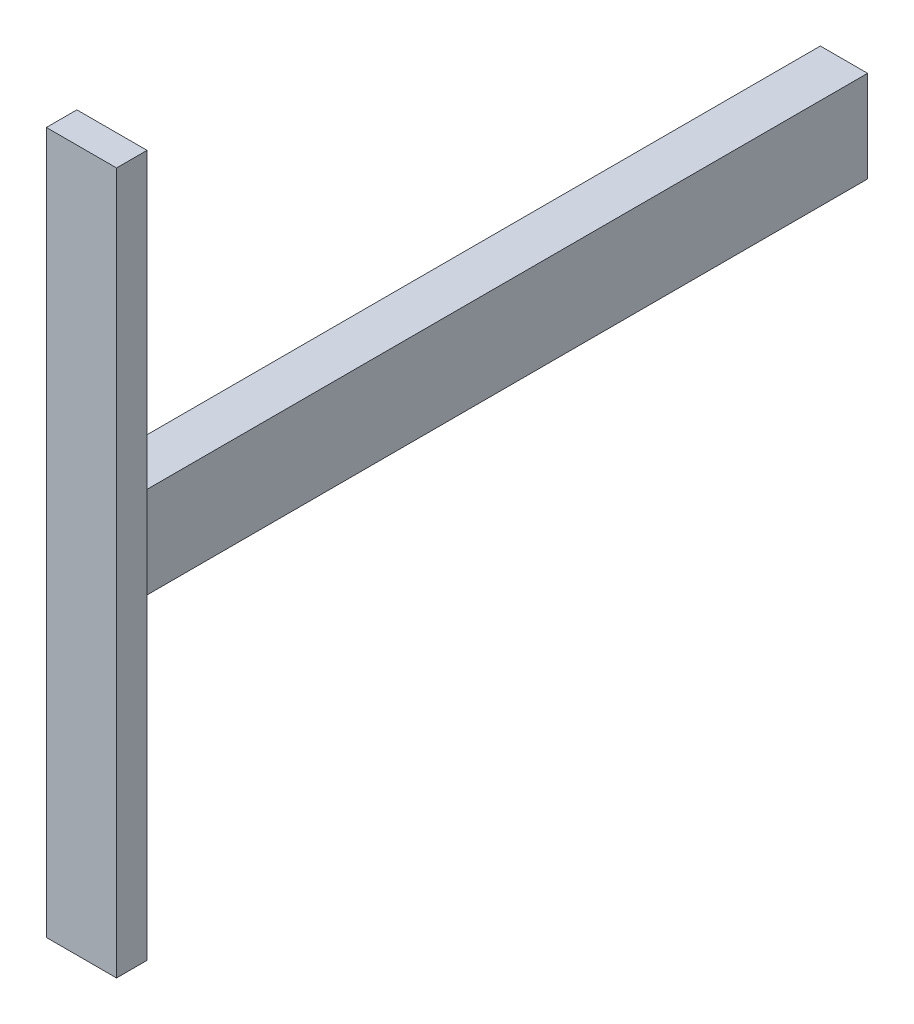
ISO-10303-21;
HEADER;
FILE_DESCRIPTION(('STEP AP214'),'2;1');
FILE_NAME('part.step','',(''),(''),'','','');
FILE_SCHEMA(('AUTOMOTIVE_DESIGN { 1 0 10303 214 1 1 1 1 }'));
ENDSEC;
DATA;
#1=APPLICATION_CONTEXT('core data for automotive mechanical design processes');
#2=APPLICATION_PROTOCOL_DEFINITION('international standard','automotive_design',2000,#1);
#3=PRODUCT_CONTEXT('',#1,'mechanical');
#4=PRODUCT('Part','Part','',(#3));
#5=PRODUCT_RELATED_PRODUCT_CATEGORY('part','',(#4));
#6=PRODUCT_DEFINITION_FORMATION('','',#4);
#7=PRODUCT_DEFINITION_CONTEXT('part definition',#1,'design');
#8=PRODUCT_DEFINITION('design','',#6,#7);
#9=PRODUCT_DEFINITION_SHAPE('','',#8);
#10=(LENGTH_UNIT() NAMED_UNIT(*) SI_UNIT(.MILLI.,.METRE.));
#11=(NAMED_UNIT(*) PLANE_ANGLE_UNIT() SI_UNIT($,.RADIAN.));
#12=(NAMED_UNIT(*) SI_UNIT($,.STERADIAN.) SOLID_ANGLE_UNIT());
#13=UNCERTAINTY_MEASURE_WITH_UNIT(LENGTH_MEASURE(1.E-05),#10,'distance_accuracy_value','');
#14=(GEOMETRIC_REPRESENTATION_CONTEXT(3) GLOBAL_UNCERTAINTY_ASSIGNED_CONTEXT((#13)) GLOBAL_UNIT_ASSIGNED_CONTEXT((#10,
#11,#12)) REPRESENTATION_CONTEXT('',''));
#15=CARTESIAN_POINT('',(0.,0.,0.));
#16=DIRECTION('',(0.,0.,1.));
#17=DIRECTION('',(1.,0.,0.));
#18=AXIS2_PLACEMENT_3D('',#15,#16,#17);
#19=CARTESIAN_POINT('',(-29.21,584.2,-12.7));
#20=DIRECTION('',(0.,0.,1.));
#21=DIRECTION('',(1.,0.,0.));
#22=AXIS2_PLACEMENT_3D('',#19,#20,#21);
#23=PLANE('',#22);
#24=DIRECTION('',(-1.,0.,0.));
#25=VECTOR('',#24,1.);
#26=CARTESIAN_POINT('',(-29.21,0.,-12.7));
#27=LINE('',#26,#25);
#28=CARTESIAN_POINT('',(29.21,0.,-12.7));
#29=VERTEX_POINT('',#28);
#30=CARTESIAN_POINT('',(-29.21,0.,-12.7));
#31=VERTEX_POINT('',#30);
#32=EDGE_CURVE('E240',#29,#31,#27,.T.);
#33=ORIENTED_EDGE('',*,*,#32,.T.);
#34=DIRECTION('',(0.,-1.,0.));
#35=VECTOR('',#34,1.);
#36=CARTESIAN_POINT('',(-29.21,584.2,-12.7));
#37=LINE('',#36,#35);
#38=CARTESIAN_POINT('',(-29.21,584.2,-12.7));
#39=VERTEX_POINT('',#38);
#40=EDGE_CURVE('E48',#39,#31,#37,.T.);
#41=ORIENTED_EDGE('',*,*,#40,.F.);
#42=DIRECTION('',(-1.,0.,0.));
#43=VECTOR('',#42,1.);
#44=CARTESIAN_POINT('',(-29.21,584.2,-12.7));
#45=LINE('',#44,#43);
#46=CARTESIAN_POINT('',(29.21,584.2,-12.7));
#47=VERTEX_POINT('',#46);
#48=EDGE_CURVE('E226',#47,#39,#45,.T.);
#49=ORIENTED_EDGE('',*,*,#48,.F.);
#50=DIRECTION('',(0.,-1.,0.));
#51=VECTOR('',#50,1.);
#52=CARTESIAN_POINT('',(29.21,584.2,-12.7));
#53=LINE('',#52,#51);
#54=EDGE_CURVE('E11',#47,#29,#53,.T.);
#55=ORIENTED_EDGE('',*,*,#54,.T.);
#56=EDGE_LOOP('',(#33,#41,#49,#55));
#57=FACE_BOUND('',#56,.T.);
#58=DIRECTION('',(0.,-1.,0.));
#59=VECTOR('',#58,1.);
#60=CARTESIAN_POINT('',(19.685,254.,-12.7));
#61=LINE('',#60,#59);
#62=CARTESIAN_POINT('',(19.685,330.2,-12.7));
#63=VERTEX_POINT('',#62);
#64=CARTESIAN_POINT('',(19.685,254.,-12.7));
#65=VERTEX_POINT('',#64);
#66=EDGE_CURVE('E148',#63,#65,#61,.T.);
#67=ORIENTED_EDGE('',*,*,#66,.F.);
#68=DIRECTION('',(1.,0.,0.));
#69=VECTOR('',#68,1.);
#70=CARTESIAN_POINT('',(19.685,330.2,-12.7));
#71=LINE('',#70,#69);
#72=CARTESIAN_POINT('',(-19.685,330.2,-12.7));
#73=VERTEX_POINT('',#72);
#74=EDGE_CURVE('E187',#73,#63,#71,.T.);
#75=ORIENTED_EDGE('',*,*,#74,.F.);
#76=DIRECTION('',(0.,1.,0.));
#77=VECTOR('',#76,1.);
#78=CARTESIAN_POINT('',(-19.685,254.,-12.7));
#79=LINE('',#78,#77);
#80=CARTESIAN_POINT('',(-19.685,254.,-12.7));
#81=VERTEX_POINT('',#80);
#82=EDGE_CURVE('E60',#81,#73,#79,.T.);
#83=ORIENTED_EDGE('',*,*,#82,.F.);
#84=DIRECTION('',(-1.,0.,0.));
#85=VECTOR('',#84,1.);
#86=CARTESIAN_POINT('',(19.685,254.,-12.7));
#87=LINE('',#86,#85);
#88=EDGE_CURVE('E55',#65,#81,#87,.T.);
#89=ORIENTED_EDGE('',*,*,#88,.F.);
#90=EDGE_LOOP('',(#67,#75,#83,#89));
#91=FACE_BOUND('',#90,.T.);
#92=ADVANCED_FACE('F39',(#57,#91),#23,.F.);
#93=CARTESIAN_POINT('',(29.21,584.2,-12.7));
#94=DIRECTION('',(-1.,0.,0.));
#95=DIRECTION('',(0.,0.,1.));
#96=AXIS2_PLACEMENT_3D('',#93,#94,#95);
#97=PLANE('',#96);
#98=DIRECTION('',(0.,0.,-1.));
#99=VECTOR('',#98,1.);
#100=CARTESIAN_POINT('',(29.21,0.,-12.7));
#101=LINE('',#100,#99);
#102=CARTESIAN_POINT('',(29.21,0.,12.7));
#103=VERTEX_POINT('',#102);
#104=EDGE_CURVE('E221',#103,#29,#101,.T.);
#105=ORIENTED_EDGE('',*,*,#104,.T.);
#106=ORIENTED_EDGE('',*,*,#54,.F.);
#107=DIRECTION('',(0.,0.,-1.));
#108=VECTOR('',#107,1.);
#109=CARTESIAN_POINT('',(29.21,584.2,-12.7));
#110=LINE('',#109,#108);
#111=CARTESIAN_POINT('',(29.21,584.2,12.7));
#112=VERTEX_POINT('',#111);
#113=EDGE_CURVE('E222',#112,#47,#110,.T.);
#114=ORIENTED_EDGE('',*,*,#113,.F.);
#115=DIRECTION('',(0.,-1.,0.));
#116=VECTOR('',#115,1.);
#117=CARTESIAN_POINT('',(29.21,584.2,12.7));
#118=LINE('',#117,#116);
#119=EDGE_CURVE('E236',#112,#103,#118,.T.);
#120=ORIENTED_EDGE('',*,*,#119,.T.);
#121=EDGE_LOOP('',(#105,#106,#114,#120));
#122=FACE_BOUND('',#121,.T.);
#123=ADVANCED_FACE('F41',(#122),#97,.F.);
#124=CARTESIAN_POINT('',(-29.21,584.2,-12.7));
#125=DIRECTION('',(1.,0.,0.));
#126=DIRECTION('',(0.,0.,-1.));
#127=AXIS2_PLACEMENT_3D('',#124,#125,#126);
#128=PLANE('',#127);
#129=DIRECTION('',(0.,0.,1.));
#130=VECTOR('',#129,1.);
#131=CARTESIAN_POINT('',(-29.21,0.,-12.7));
#132=LINE('',#131,#130);
#133=CARTESIAN_POINT('',(-29.21,0.,12.7));
#134=VERTEX_POINT('',#133);
#135=EDGE_CURVE('E243',#31,#134,#132,.T.);
#136=ORIENTED_EDGE('',*,*,#135,.T.);
#137=DIRECTION('',(0.,-1.,0.));
#138=VECTOR('',#137,1.);
#139=CARTESIAN_POINT('',(-29.21,584.2,12.7));
#140=LINE('',#139,#138);
#141=CARTESIAN_POINT('',(-29.21,584.2,12.7));
#142=VERTEX_POINT('',#141);
#143=EDGE_CURVE('E251',#142,#134,#140,.T.);
#144=ORIENTED_EDGE('',*,*,#143,.F.);
#145=DIRECTION('',(0.,0.,1.));
#146=VECTOR('',#145,1.);
#147=CARTESIAN_POINT('',(-29.21,584.2,-12.7));
#148=LINE('',#147,#146);
#149=EDGE_CURVE('E230',#39,#142,#148,.T.);
#150=ORIENTED_EDGE('',*,*,#149,.F.);
#151=ORIENTED_EDGE('',*,*,#40,.T.);
#152=EDGE_LOOP('',(#136,#144,#150,#151));
#153=FACE_BOUND('',#152,.T.);
#154=ADVANCED_FACE('F260',(#153),#128,.F.);
#155=CARTESIAN_POINT('',(-29.21,584.2,12.7));
#156=DIRECTION('',(0.,0.,-1.));
#157=DIRECTION('',(-1.,0.,0.));
#158=AXIS2_PLACEMENT_3D('',#155,#156,#157);
#159=PLANE('',#158);
#160=DIRECTION('',(1.,0.,0.));
#161=VECTOR('',#160,1.);
#162=CARTESIAN_POINT('',(-29.21,0.,12.7));
#163=LINE('',#162,#161);
#164=EDGE_CURVE('E227',#134,#103,#163,.T.);
#165=ORIENTED_EDGE('',*,*,#164,.T.);
#166=ORIENTED_EDGE('',*,*,#119,.F.);
#167=DIRECTION('',(1.,0.,0.));
#168=VECTOR('',#167,1.);
#169=CARTESIAN_POINT('',(-29.21,584.2,12.7));
#170=LINE('',#169,#168);
#171=EDGE_CURVE('E233',#142,#112,#170,.T.);
#172=ORIENTED_EDGE('',*,*,#171,.F.);
#173=ORIENTED_EDGE('',*,*,#143,.T.);
#174=EDGE_LOOP('',(#165,#166,#172,#173));
#175=FACE_BOUND('',#174,.T.);
#176=ADVANCED_FACE('F269',(#175),#159,.F.);
#177=CARTESIAN_POINT('',(0.,584.2,0.));
#178=DIRECTION('',(0.,1.,0.));
#179=DIRECTION('',(0.,0.,1.));
#180=AXIS2_PLACEMENT_3D('',#177,#178,#179);
#181=PLANE('',#180);
#182=ORIENTED_EDGE('',*,*,#113,.T.);
#183=ORIENTED_EDGE('',*,*,#48,.T.);
#184=ORIENTED_EDGE('',*,*,#149,.T.);
#185=ORIENTED_EDGE('',*,*,#171,.T.);
#186=EDGE_LOOP('',(#182,#183,#184,#185));
#187=FACE_BOUND('',#186,.T.);
#188=ADVANCED_FACE('F275',(#187),#181,.T.);
#189=CARTESIAN_POINT('',(0.,0.,0.));
#190=DIRECTION('',(0.,1.,0.));
#191=DIRECTION('',(0.,0.,1.));
#192=AXIS2_PLACEMENT_3D('',#189,#190,#191);
#193=PLANE('',#192);
#194=ORIENTED_EDGE('',*,*,#104,.F.);
#195=ORIENTED_EDGE('',*,*,#164,.F.);
#196=ORIENTED_EDGE('',*,*,#135,.F.);
#197=ORIENTED_EDGE('',*,*,#32,.F.);
#198=EDGE_LOOP('',(#194,#195,#196,#197));
#199=FACE_BOUND('',#198,.T.);
#200=ADVANCED_FACE('F266',(#199),#193,.F.);
#201=CARTESIAN_POINT('',(0.,0.,-622.3));
#202=DIRECTION('',(0.,0.,1.));
#203=DIRECTION('',(1.,0.,0.));
#204=AXIS2_PLACEMENT_3D('',#201,#202,#203);
#205=PLANE('',#204);
#206=DIRECTION('',(0.,-1.,0.));
#207=VECTOR('',#206,1.);
#208=CARTESIAN_POINT('',(19.685,254.,-622.3));
#209=LINE('',#208,#207);
#210=CARTESIAN_POINT('',(19.685,330.2,-622.3));
#211=VERTEX_POINT('',#210);
#212=CARTESIAN_POINT('',(19.685,254.,-622.3));
#213=VERTEX_POINT('',#212);
#214=EDGE_CURVE('E182',#211,#213,#209,.T.);
#215=ORIENTED_EDGE('',*,*,#214,.T.);
#216=DIRECTION('',(-1.,0.,0.));
#217=VECTOR('',#216,1.);
#218=CARTESIAN_POINT('',(19.685,254.,-622.3));
#219=LINE('',#218,#217);
#220=CARTESIAN_POINT('',(-19.685,254.,-622.3));
#221=VERTEX_POINT('',#220);
#222=EDGE_CURVE('E186',#213,#221,#219,.T.);
#223=ORIENTED_EDGE('',*,*,#222,.T.);
#224=DIRECTION('',(0.,1.,0.));
#225=VECTOR('',#224,1.);
#226=CARTESIAN_POINT('',(-19.685,254.,-622.3));
#227=LINE('',#226,#225);
#228=CARTESIAN_POINT('',(-19.685,330.2,-622.3));
#229=VERTEX_POINT('',#228);
#230=EDGE_CURVE('E190',#221,#229,#227,.T.);
#231=ORIENTED_EDGE('',*,*,#230,.T.);
#232=DIRECTION('',(1.,0.,0.));
#233=VECTOR('',#232,1.);
#234=CARTESIAN_POINT('',(19.685,330.2,-622.3));
#235=LINE('',#234,#233);
#236=EDGE_CURVE('E193',#229,#211,#235,.T.);
#237=ORIENTED_EDGE('',*,*,#236,.T.);
#238=EDGE_LOOP('',(#215,#223,#231,#237));
#239=FACE_BOUND('',#238,.T.);
#240=DIRECTION('',(0.,-1.,0.));
#241=VECTOR('',#240,1.);
#242=CARTESIAN_POINT('',(16.51,257.175,-622.3));
#243=LINE('',#242,#241);
#244=CARTESIAN_POINT('',(16.51,327.025,-622.3));
#245=VERTEX_POINT('',#244);
#246=CARTESIAN_POINT('',(16.51,257.175,-622.3));
#247=VERTEX_POINT('',#246);
#248=EDGE_CURVE('E128',#245,#247,#243,.T.);
#249=ORIENTED_EDGE('',*,*,#248,.F.);
#250=DIRECTION('',(1.,0.,0.));
#251=VECTOR('',#250,1.);
#252=CARTESIAN_POINT('',(16.51,327.025,-622.3));
#253=LINE('',#252,#251);
#254=CARTESIAN_POINT('',(-16.51,327.025,-622.3));
#255=VERTEX_POINT('',#254);
#256=EDGE_CURVE('E158',#255,#245,#253,.T.);
#257=ORIENTED_EDGE('',*,*,#256,.F.);
#258=DIRECTION('',(0.,1.,0.));
#259=VECTOR('',#258,1.);
#260=CARTESIAN_POINT('',(-16.51,257.175,-622.3));
#261=LINE('',#260,#259);
#262=CARTESIAN_POINT('',(-16.51,257.175,-622.3));
#263=VERTEX_POINT('',#262);
#264=EDGE_CURVE('E154',#263,#255,#261,.T.);
#265=ORIENTED_EDGE('',*,*,#264,.F.);
#266=DIRECTION('',(-1.,0.,0.));
#267=VECTOR('',#266,1.);
#268=CARTESIAN_POINT('',(16.51,257.175,-622.3));
#269=LINE('',#268,#267);
#270=EDGE_CURVE('E139',#247,#263,#269,.T.);
#271=ORIENTED_EDGE('',*,*,#270,.F.);
#272=EDGE_LOOP('',(#249,#257,#265,#271));
#273=FACE_BOUND('',#272,.T.);
#274=ADVANCED_FACE('F152',(#239,#273),#205,.F.);
#275=CARTESIAN_POINT('',(19.685,254.,-622.3));
#276=DIRECTION('',(-1.,0.,0.));
#277=DIRECTION('',(0.,0.,1.));
#278=AXIS2_PLACEMENT_3D('',#275,#276,#277);
#279=PLANE('',#278);
#280=ORIENTED_EDGE('',*,*,#66,.T.);
#281=DIRECTION('',(0.,0.,1.));
#282=VECTOR('',#281,1.);
#283=CARTESIAN_POINT('',(19.685,254.,-622.3));
#284=LINE('',#283,#282);
#285=EDGE_CURVE('E218',#213,#65,#284,.T.);
#286=ORIENTED_EDGE('',*,*,#285,.F.);
#287=ORIENTED_EDGE('',*,*,#214,.F.);
#288=DIRECTION('',(0.,0.,1.));
#289=VECTOR('',#288,1.);
#290=CARTESIAN_POINT('',(19.685,330.2,-622.3));
#291=LINE('',#290,#289);
#292=EDGE_CURVE('E196',#211,#63,#291,.T.);
#293=ORIENTED_EDGE('',*,*,#292,.T.);
#294=EDGE_LOOP('',(#280,#286,#287,#293));
#295=FACE_BOUND('',#294,.T.);
#296=ADVANCED_FACE('F286',(#295),#279,.F.);
#297=CARTESIAN_POINT('',(19.685,254.,-622.3));
#298=DIRECTION('',(0.,1.,0.));
#299=DIRECTION('',(0.,0.,1.));
#300=AXIS2_PLACEMENT_3D('',#297,#298,#299);
#301=PLANE('',#300);
#302=ORIENTED_EDGE('',*,*,#88,.T.);
#303=DIRECTION('',(0.,0.,1.));
#304=VECTOR('',#303,1.);
#305=CARTESIAN_POINT('',(-19.685,254.,-622.3));
#306=LINE('',#305,#304);
#307=EDGE_CURVE('E214',#221,#81,#306,.T.);
#308=ORIENTED_EDGE('',*,*,#307,.F.);
#309=ORIENTED_EDGE('',*,*,#222,.F.);
#310=ORIENTED_EDGE('',*,*,#285,.T.);
#311=EDGE_LOOP('',(#302,#308,#309,#310));
#312=FACE_BOUND('',#311,.T.);
#313=ADVANCED_FACE('F293',(#312),#301,.F.);
#314=CARTESIAN_POINT('',(-19.685,254.,-622.3));
#315=DIRECTION('',(1.,0.,0.));
#316=DIRECTION('',(0.,0.,-1.));
#317=AXIS2_PLACEMENT_3D('',#314,#315,#316);
#318=PLANE('',#317);
#319=ORIENTED_EDGE('',*,*,#82,.T.);
#320=DIRECTION('',(0.,0.,1.));
#321=VECTOR('',#320,1.);
#322=CARTESIAN_POINT('',(-19.685,330.2,-622.3));
#323=LINE('',#322,#321);
#324=EDGE_CURVE('E210',#229,#73,#323,.T.);
#325=ORIENTED_EDGE('',*,*,#324,.F.);
#326=ORIENTED_EDGE('',*,*,#230,.F.);
#327=ORIENTED_EDGE('',*,*,#307,.T.);
#328=EDGE_LOOP('',(#319,#325,#326,#327));
#329=FACE_BOUND('',#328,.T.);
#330=ADVANCED_FACE('F291',(#329),#318,.F.);
#331=CARTESIAN_POINT('',(19.685,330.2,-622.3));
#332=DIRECTION('',(0.,-1.,0.));
#333=DIRECTION('',(0.,0.,-1.));
#334=AXIS2_PLACEMENT_3D('',#331,#332,#333);
#335=PLANE('',#334);
#336=ORIENTED_EDGE('',*,*,#74,.T.);
#337=ORIENTED_EDGE('',*,*,#292,.F.);
#338=ORIENTED_EDGE('',*,*,#236,.F.);
#339=ORIENTED_EDGE('',*,*,#324,.T.);
#340=EDGE_LOOP('',(#336,#337,#338,#339));
#341=FACE_BOUND('',#340,.T.);
#342=ADVANCED_FACE('F282',(#341),#335,.F.);
#343=CARTESIAN_POINT('',(16.51,257.175,-622.3));
#344=DIRECTION('',(-1.,0.,0.));
#345=DIRECTION('',(0.,0.,1.));
#346=AXIS2_PLACEMENT_3D('',#343,#344,#345);
#347=PLANE('',#346);
#348=DIRECTION('',(0.,-1.,0.));
#349=VECTOR('',#348,1.);
#350=CARTESIAN_POINT('',(16.51,257.175,-12.7));
#351=LINE('',#350,#349);
#352=CARTESIAN_POINT('',(16.51,327.025,-12.7));
#353=VERTEX_POINT('',#352);
#354=CARTESIAN_POINT('',(16.51,257.175,-12.7));
#355=VERTEX_POINT('',#354);
#356=EDGE_CURVE('E163',#353,#355,#351,.T.);
#357=ORIENTED_EDGE('',*,*,#356,.F.);
#358=DIRECTION('',(0.,0.,1.));
#359=VECTOR('',#358,1.);
#360=CARTESIAN_POINT('',(16.51,327.025,-622.3));
#361=LINE('',#360,#359);
#362=EDGE_CURVE('E134',#245,#353,#361,.T.);
#363=ORIENTED_EDGE('',*,*,#362,.F.);
#364=ORIENTED_EDGE('',*,*,#248,.T.);
#365=DIRECTION('',(0.,0.,1.));
#366=VECTOR('',#365,1.);
#367=CARTESIAN_POINT('',(16.51,257.175,-622.3));
#368=LINE('',#367,#366);
#369=EDGE_CURVE('E132',#247,#355,#368,.T.);
#370=ORIENTED_EDGE('',*,*,#369,.T.);
#371=EDGE_LOOP('',(#357,#363,#364,#370));
#372=FACE_BOUND('',#371,.T.);
#373=ADVANCED_FACE('F131',(#372),#347,.T.);
#374=CARTESIAN_POINT('',(16.51,257.175,-622.3));
#375=DIRECTION('',(0.,1.,0.));
#376=DIRECTION('',(0.,0.,1.));
#377=AXIS2_PLACEMENT_3D('',#374,#375,#376);
#378=PLANE('',#377);
#379=DIRECTION('',(-1.,0.,0.));
#380=VECTOR('',#379,1.);
#381=CARTESIAN_POINT('',(16.51,257.175,-12.7));
#382=LINE('',#381,#380);
#383=CARTESIAN_POINT('',(-16.51,257.175,-12.7));
#384=VERTEX_POINT('',#383);
#385=EDGE_CURVE('E146',#355,#384,#382,.T.);
#386=ORIENTED_EDGE('',*,*,#385,.F.);
#387=ORIENTED_EDGE('',*,*,#369,.F.);
#388=ORIENTED_EDGE('',*,*,#270,.T.);
#389=DIRECTION('',(0.,0.,1.));
#390=VECTOR('',#389,1.);
#391=CARTESIAN_POINT('',(-16.51,257.175,-622.3));
#392=LINE('',#391,#390);
#393=EDGE_CURVE('E149',#263,#384,#392,.T.);
#394=ORIENTED_EDGE('',*,*,#393,.T.);
#395=EDGE_LOOP('',(#386,#387,#388,#394));
#396=FACE_BOUND('',#395,.T.);
#397=ADVANCED_FACE('F143',(#396),#378,.T.);
#398=CARTESIAN_POINT('',(-16.51,257.175,-622.3));
#399=DIRECTION('',(1.,0.,0.));
#400=DIRECTION('',(0.,0.,-1.));
#401=AXIS2_PLACEMENT_3D('',#398,#399,#400);
#402=PLANE('',#401);
#403=DIRECTION('',(0.,1.,0.));
#404=VECTOR('',#403,1.);
#405=CARTESIAN_POINT('',(-16.51,257.175,-12.7));
#406=LINE('',#405,#404);
#407=CARTESIAN_POINT('',(-16.51,327.025,-12.7));
#408=VERTEX_POINT('',#407);
#409=EDGE_CURVE('E168',#384,#408,#406,.T.);
#410=ORIENTED_EDGE('',*,*,#409,.F.);
#411=ORIENTED_EDGE('',*,*,#393,.F.);
#412=ORIENTED_EDGE('',*,*,#264,.T.);
#413=DIRECTION('',(0.,0.,1.));
#414=VECTOR('',#413,1.);
#415=CARTESIAN_POINT('',(-16.51,327.025,-622.3));
#416=LINE('',#415,#414);
#417=EDGE_CURVE('E177',#255,#408,#416,.T.);
#418=ORIENTED_EDGE('',*,*,#417,.T.);
#419=EDGE_LOOP('',(#410,#411,#412,#418));
#420=FACE_BOUND('',#419,.T.);
#421=ADVANCED_FACE('F317',(#420),#402,.T.);
#422=CARTESIAN_POINT('',(16.51,327.025,-622.3));
#423=DIRECTION('',(0.,-1.,0.));
#424=DIRECTION('',(0.,0.,-1.));
#425=AXIS2_PLACEMENT_3D('',#422,#423,#424);
#426=PLANE('',#425);
#427=DIRECTION('',(1.,0.,0.));
#428=VECTOR('',#427,1.);
#429=CARTESIAN_POINT('',(16.51,327.025,-12.7));
#430=LINE('',#429,#428);
#431=EDGE_CURVE('E140',#408,#353,#430,.T.);
#432=ORIENTED_EDGE('',*,*,#431,.F.);
#433=ORIENTED_EDGE('',*,*,#417,.F.);
#434=ORIENTED_EDGE('',*,*,#256,.T.);
#435=ORIENTED_EDGE('',*,*,#362,.T.);
#436=EDGE_LOOP('',(#432,#433,#434,#435));
#437=FACE_BOUND('',#436,.T.);
#438=ADVANCED_FACE('F312',(#437),#426,.T.);
#439=ORIENTED_EDGE('',*,*,#431,.T.);
#440=ORIENTED_EDGE('',*,*,#356,.T.);
#441=ORIENTED_EDGE('',*,*,#385,.T.);
#442=ORIENTED_EDGE('',*,*,#409,.T.);
#443=EDGE_LOOP('',(#439,#440,#441,#442));
#444=FACE_BOUND('',#443,.T.);
#445=ADVANCED_FACE('F277',(#444),#23,.F.);
#446=CLOSED_SHELL('',(#92,#123,#154,#176,#188,#200,#274,#296,#313,#330,#342,#373,#397,#421,#438,#445));
#447=MANIFOLD_SOLID_BREP('B2',#446);
#448=ADVANCED_BREP_SHAPE_REPRESENTATION('',(#18,#447),#14);
#449=SHAPE_DEFINITION_REPRESENTATION(#9,#448);
ENDSEC;
END-ISO-10303-21;
